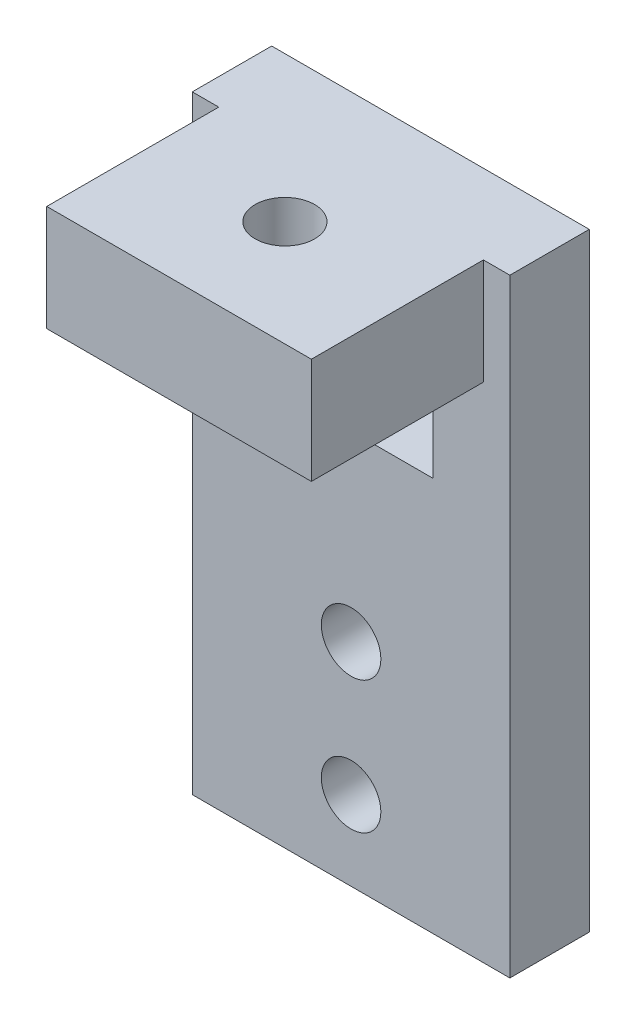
from build123d import *

# Parameters (mm, degrees)
SKETCH_1_W                        = 24
SKETCH_1_H                        = 46
SKETCH_1_R                        = 2.25
SKETCH_1_W_2                      = 12.4
SKETCH_1_H_2                      = 8.4
SHOE_FOOT_M4_CLEARANCE_DEPTH      = 6
SKETCH_2_W                        = 20
SKETCH_2_H                        = 13
SKETCH_2_R                        = 2.25
UPRIGHT_FIXED_M4_CROSS_BOLT_DEPTH = 8


with BuildPart() as part:
    # Sketch 1 → Shoe_foot_M4_clearance (new body)
    with BuildSketch(Plane.XY):
        with Locations((0, -15)):
            Rectangle(SKETCH_1_W, SKETCH_1_H)
        with Locations((0, -32)):
            Circle(SKETCH_1_R, mode=Mode.SUBTRACT)
        with Locations((0, -22)):
            Circle(SKETCH_1_R, mode=Mode.SUBTRACT)
        with Locations((0, -4)):
            Rectangle(SKETCH_1_W_2, SKETCH_1_H_2, mode=Mode.SUBTRACT)
    extrude(amount=SHOE_FOOT_M4_CLEARANCE_DEPTH)

    # Sketch 2 → Upright_fixed_M4_cross_bolt (add)
    with BuildSketch(Plane(origin=(0, 0, 0), x_dir=(1, 0, 0), z_dir=(0, 1, 0))):
        with Locations((0, -12.5)):
            Rectangle(SKETCH_2_W, SKETCH_2_H)
        with Locations(Location((0, -11, 0), (0, 0, 270))):
            Circle(SKETCH_2_R, mode=Mode.SUBTRACT)
    extrude(amount=UPRIGHT_FIXED_M4_CROSS_BOLT_DEPTH)


solid = part.part
